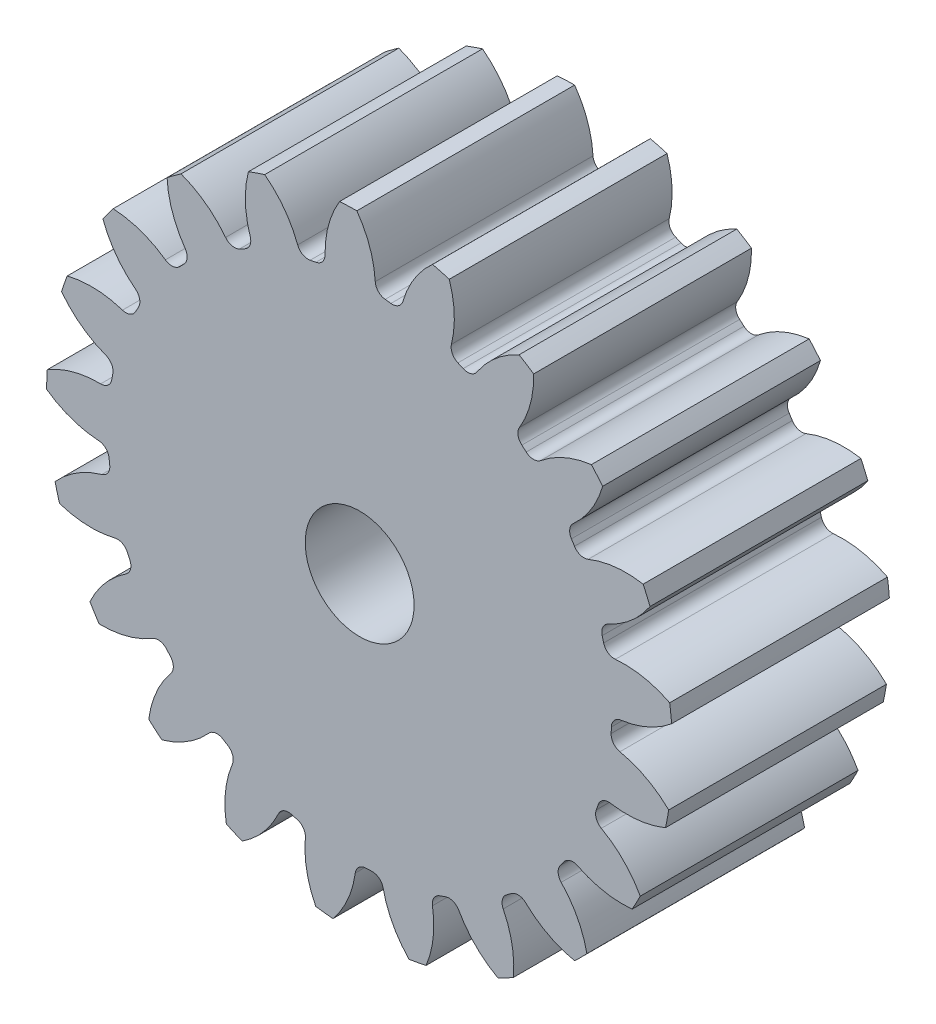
from build123d import *

# Parameters (mm, degrees)
SKETCH3_R         = 146.05
GEARBODY_DEPTH    = 101.6
TOOTHCUT_DEPTH    = 231.182025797
CIRPATTERN1_COUNT = 21
BOREDIA_R         = 25.4
BORE_DEPTH        = 12700


with BuildPart() as part:
    # Sketch3 → gearBody (new body)
    with BuildSketch(Plane.XY):
        Circle(SKETCH3_R)
    extrude(amount=GEARBODY_DEPTH)

    # Sketch2 → toothCut (cut, through all)
    with BuildSketch(Plane.XY):
        with BuildLine():
            ThreePointArc((117.329587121, -5.843253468), (117.388987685, -4.494573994), (117.432885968, -3.14530097))
            ThreePointArc((117.432885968, -3.14530097), (118.756907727, 0.172992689), (121.916907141, 1.839879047))
            ThreePointArc((121.916907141, 1.839879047), (134.766494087, 5.487400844), (146.05, 12.635742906))
            ThreePointArc((146.05, 12.635742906), (146.488247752, -5.608722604), (144.656244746, -23.766265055))
            ThreePointArc((144.656244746, -23.766265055), (133.95236103, -15.776072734), (121.419295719, -11.156703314))
            ThreePointArc((121.419295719, -11.156703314), (118.396003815, -9.253071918), (117.329587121, -5.843253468))
        make_face()
    toothcut = extrude(amount=TOOTHCUT_DEPTH, mode=Mode.SUBTRACT)

    # CirPattern1: toothCut ×21 about axis
    cirpattern1_axis = Axis((0, 0, 0), (0, 0, 1))
    for i in range(1, CIRPATTERN1_COUNT):
        add(toothcut.rotate(cirpattern1_axis, i * 360 / CIRPATTERN1_COUNT), mode=Mode.SUBTRACT)

    # boreDia → bore (cut, symmetric)
    with BuildSketch(Plane.XY):
        Circle(BOREDIA_R)
    extrude(amount=BORE_DEPTH, both=True, mode=Mode.SUBTRACT)


solid = part.part
